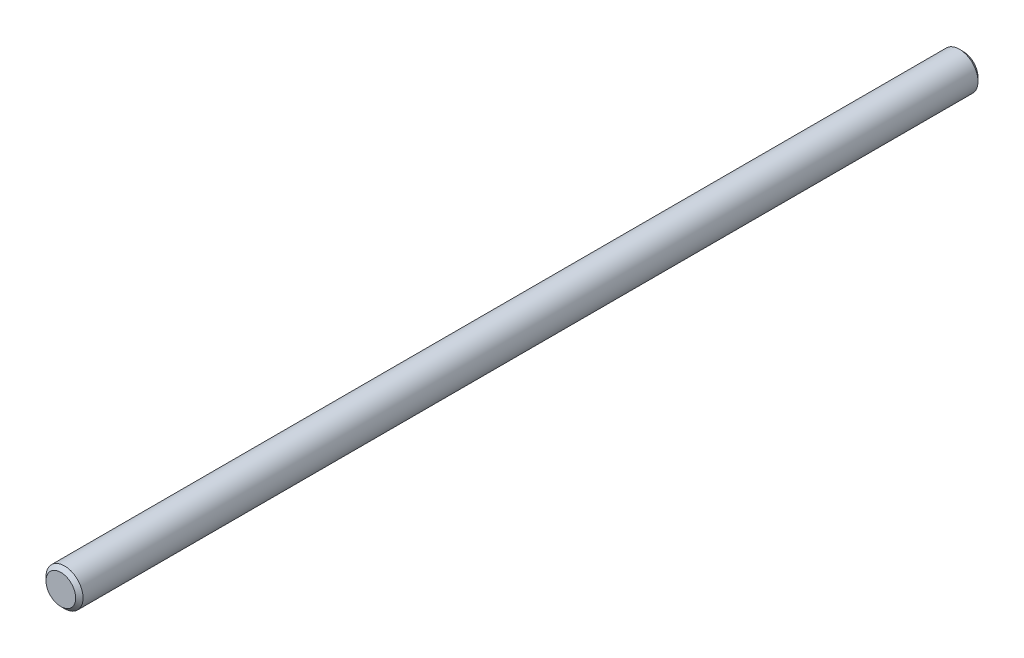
ISO-10303-21;
HEADER;
FILE_DESCRIPTION(('STEP AP214'),'2;1');
FILE_NAME('part.step','',(''),(''),'','','');
FILE_SCHEMA(('AUTOMOTIVE_DESIGN { 1 0 10303 214 1 1 1 1 }'));
ENDSEC;
DATA;
#1=APPLICATION_CONTEXT('core data for automotive mechanical design processes');
#2=APPLICATION_PROTOCOL_DEFINITION('international standard','automotive_design',2000,#1);
#3=PRODUCT_CONTEXT('',#1,'mechanical');
#4=PRODUCT('Part','Part','',(#3));
#5=PRODUCT_RELATED_PRODUCT_CATEGORY('part','',(#4));
#6=PRODUCT_DEFINITION_FORMATION('','',#4);
#7=PRODUCT_DEFINITION_CONTEXT('part definition',#1,'design');
#8=PRODUCT_DEFINITION('design','',#6,#7);
#9=PRODUCT_DEFINITION_SHAPE('','',#8);
#10=(LENGTH_UNIT() NAMED_UNIT(*) SI_UNIT(.MILLI.,.METRE.));
#11=(NAMED_UNIT(*) PLANE_ANGLE_UNIT() SI_UNIT($,.RADIAN.));
#12=(NAMED_UNIT(*) SI_UNIT($,.STERADIAN.) SOLID_ANGLE_UNIT());
#13=UNCERTAINTY_MEASURE_WITH_UNIT(LENGTH_MEASURE(1.E-05),#10,'distance_accuracy_value','');
#14=(GEOMETRIC_REPRESENTATION_CONTEXT(3) GLOBAL_UNCERTAINTY_ASSIGNED_CONTEXT((#13)) GLOBAL_UNIT_ASSIGNED_CONTEXT((#10,
#11,#12)) REPRESENTATION_CONTEXT('',''));
#15=CARTESIAN_POINT('',(0.,0.,0.));
#16=DIRECTION('',(0.,0.,1.));
#17=DIRECTION('',(1.,0.,0.));
#18=AXIS2_PLACEMENT_3D('',#15,#16,#17);
#19=CARTESIAN_POINT('',(0.,0.,73.));
#20=DIRECTION('',(0.,0.,-1.));
#21=DIRECTION('',(-1.,0.,0.));
#22=AXIS2_PLACEMENT_3D('',#19,#20,#21);
#23=CYLINDRICAL_SURFACE('',#22,1.5);
#24=CARTESIAN_POINT('',(0.,0.,0.299999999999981));
#25=DIRECTION('',(0.,0.,1.));
#26=DIRECTION('',(1.,0.,0.));
#27=AXIS2_PLACEMENT_3D('',#24,#25,#26);
#28=CIRCLE('',#27,1.5);
#29=CARTESIAN_POINT('',(1.5,0.,0.299999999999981));
#30=VERTEX_POINT('',#29);
#31=EDGE_CURVE('E39',#30,#30,#28,.T.);
#32=ORIENTED_EDGE('',*,*,#31,.T.);
#33=EDGE_LOOP('',(#32));
#34=FACE_BOUND('',#33,.T.);
#35=CARTESIAN_POINT('',(0.,0.,72.7));
#36=DIRECTION('',(0.,0.,1.));
#37=DIRECTION('',(1.,0.,0.));
#38=AXIS2_PLACEMENT_3D('',#35,#36,#37);
#39=CIRCLE('',#38,1.5);
#40=CARTESIAN_POINT('',(1.5,0.,72.7));
#41=VERTEX_POINT('',#40);
#42=EDGE_CURVE('E43',#41,#41,#39,.F.);
#43=ORIENTED_EDGE('',*,*,#42,.T.);
#44=EDGE_LOOP('',(#43));
#45=FACE_BOUND('',#44,.T.);
#46=ADVANCED_FACE('F29',(#34,#45),#23,.T.);
#47=CARTESIAN_POINT('',(0.,0.,73.));
#48=DIRECTION('',(0.,0.,1.));
#49=DIRECTION('',(1.,0.,0.));
#50=AXIS2_PLACEMENT_3D('',#47,#48,#49);
#51=PLANE('',#50);
#52=CARTESIAN_POINT('',(0.,0.,73.));
#53=DIRECTION('',(0.,0.,1.));
#54=DIRECTION('',(1.,0.,0.));
#55=AXIS2_PLACEMENT_3D('',#52,#53,#54);
#56=CIRCLE('',#55,1.20000000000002);
#57=CARTESIAN_POINT('',(1.20000000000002,0.,73.));
#58=VERTEX_POINT('',#57);
#59=EDGE_CURVE('E10',#58,#58,#56,.T.);
#60=ORIENTED_EDGE('',*,*,#59,.T.);
#61=EDGE_LOOP('',(#60));
#62=FACE_BOUND('',#61,.T.);
#63=ADVANCED_FACE('F62',(#62),#51,.T.);
#64=CARTESIAN_POINT('',(0.,0.,0.));
#65=DIRECTION('',(0.,0.,1.));
#66=DIRECTION('',(1.,0.,0.));
#67=AXIS2_PLACEMENT_3D('',#64,#65,#66);
#68=PLANE('',#67);
#69=CARTESIAN_POINT('',(0.,0.,0.));
#70=DIRECTION('',(0.,0.,1.));
#71=DIRECTION('',(1.,0.,0.));
#72=AXIS2_PLACEMENT_3D('',#69,#70,#71);
#73=CIRCLE('',#72,1.20000000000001);
#74=CARTESIAN_POINT('',(1.20000000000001,0.,0.));
#75=VERTEX_POINT('',#74);
#76=EDGE_CURVE('E35',#75,#75,#73,.F.);
#77=ORIENTED_EDGE('',*,*,#76,.T.);
#78=EDGE_LOOP('',(#77));
#79=FACE_BOUND('',#78,.T.);
#80=ADVANCED_FACE('F58',(#79),#68,.F.);
#81=CARTESIAN_POINT('',(0.,0.,0.299999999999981));
#82=DIRECTION('',(0.,0.,1.));
#83=DIRECTION('',(1.,0.,0.));
#84=AXIS2_PLACEMENT_3D('',#81,#82,#83);
#85=CONICAL_SURFACE('',#84,1.5,0.785398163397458);
#86=ORIENTED_EDGE('',*,*,#76,.F.);
#87=EDGE_LOOP('',(#86));
#88=FACE_BOUND('',#87,.T.);
#89=ORIENTED_EDGE('',*,*,#31,.F.);
#90=EDGE_LOOP('',(#89));
#91=FACE_BOUND('',#90,.T.);
#92=ADVANCED_FACE('F53',(#88,#91),#85,.T.);
#93=CARTESIAN_POINT('',(0.,0.,73.));
#94=DIRECTION('',(0.,0.,-1.));
#95=DIRECTION('',(-1.,0.,0.));
#96=AXIS2_PLACEMENT_3D('',#93,#94,#95);
#97=CONICAL_SURFACE('',#96,1.20000000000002,0.78539816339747);
#98=ORIENTED_EDGE('',*,*,#42,.F.);
#99=EDGE_LOOP('',(#98));
#100=FACE_BOUND('',#99,.T.);
#101=ORIENTED_EDGE('',*,*,#59,.F.);
#102=EDGE_LOOP('',(#101));
#103=FACE_BOUND('',#102,.T.);
#104=ADVANCED_FACE('F50',(#100,#103),#97,.T.);
#105=CLOSED_SHELL('',(#46,#63,#80,#92,#104));
#106=MANIFOLD_SOLID_BREP('B2',#105);
#107=ADVANCED_BREP_SHAPE_REPRESENTATION('',(#18,#106),#14);
#108=SHAPE_DEFINITION_REPRESENTATION(#9,#107);
ENDSEC;
END-ISO-10303-21;
